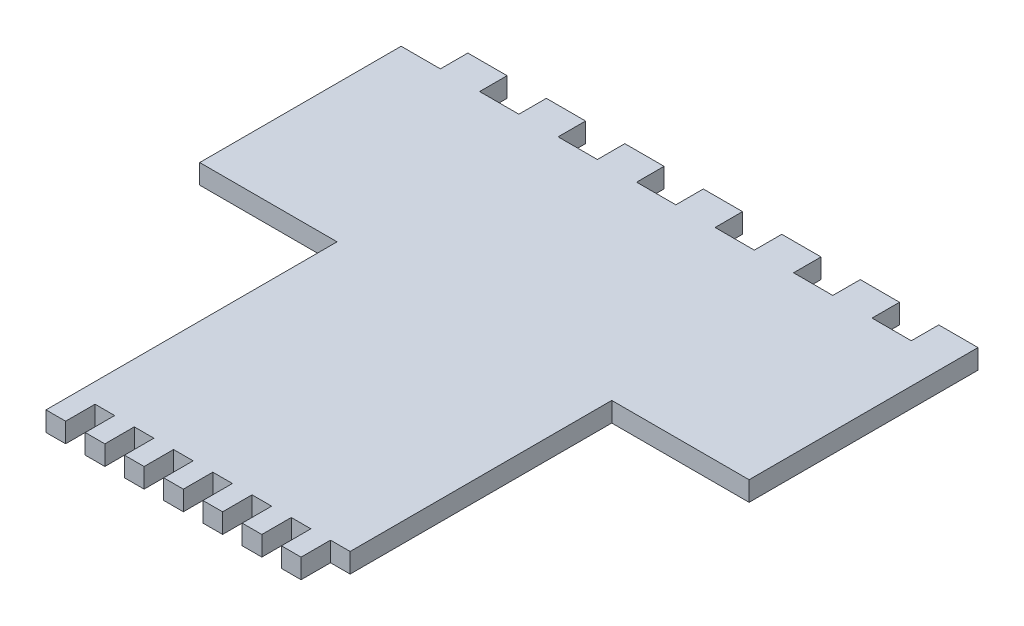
from build123d import *

# Parameters (mm, degrees)
SKETCH1_W           = 177.8
SKETCH1_H           = 169.3418
SKETCH1_W_2         = 355.6
SKETCH1_H_2         = 148.1582
BOSS_EXTRUDE1_DEPTH = 12.7
SKETCH2_W           = 12.7
SKETCH2_H           = 12.7
BOSS_EXTRUDE2_DEPTH = 19.05
SKETCH5_W           = 12.7
SKETCH5_H           = 12.7
CUT_EXTRUDE1_DEPTH  = 19.05
SKETCH6_W           = 12.7
SKETCH6_H           = 12.7
BOSS_EXTRUDE3_DEPTH = 19.05
SKETCH7_W           = 25.4
SKETCH7_H           = 17.78
CUT_EXTRUDE2_DEPTH  = 25.4


with BuildPart() as part:
    # Sketch1 → Boss-Extrude1 (new body)
    with BuildSketch(Plane(origin=(0, 0, 0), x_dir=(1, 0, 0), z_dir=(0, 1, 0))):
        with Locations((177.8, -232.8291)):
            Rectangle(SKETCH1_W, SKETCH1_H)
        with Locations((177.8, -74.0791)):
            Rectangle(SKETCH1_W_2, SKETCH1_H_2)
    extrude(amount=-BOSS_EXTRUDE1_DEPTH)

    # Sketch2 → Boss-Extrude2 (add)
    with BuildSketch(Plane.XY.offset(317.5)):
        Polygon((101.6, 0), (88.9, 0), (88.9, -12.7), (101.6, -12.688292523), align=None)
        with Locations((120.65, -6.35)):
            Rectangle(SKETCH2_W, SKETCH2_H)
        with Locations((146.05, -6.35)):
            Rectangle(SKETCH2_W, SKETCH2_H)
        with Locations((171.45, -6.35)):
            Rectangle(SKETCH2_W, SKETCH2_H)
        with Locations((196.85, -6.35)):
            Rectangle(SKETCH2_W, SKETCH2_H)
        with Locations((222.25, -6.35)):
            Rectangle(SKETCH2_W, SKETCH2_H)
        with Locations((247.65, -6.35)):
            Rectangle(SKETCH2_W, SKETCH2_H)
    extrude(amount=BOSS_EXTRUDE2_DEPTH)

    # Sketch5 → Cut-Extrude1 (cut)
    with BuildSketch(Plane.XY.offset(336.55)):
        with Locations((222.25, -6.35)):
            Rectangle(SKETCH5_W, SKETCH5_H)
    extrude(amount=-CUT_EXTRUDE1_DEPTH, mode=Mode.SUBTRACT)

    # Sketch6 → Boss-Extrude3 (add)
    with BuildSketch(Plane.XY.offset(317.5)):
        with Locations((222.25, -6.35)):
            Rectangle(SKETCH6_W, SKETCH6_H)
    extrude(amount=BOSS_EXTRUDE3_DEPTH)

    # Sketch7 → Cut-Extrude2 (cut)
    with BuildSketch(Plane(origin=(0, 0, 0), x_dir=(1, 0, 0), z_dir=(0, 1, 0))):
        with Locations((12.7, -8.89)):
            Rectangle(SKETCH7_W, SKETCH7_H)
        with Locations((63.5, -8.89)):
            Rectangle(SKETCH7_W, SKETCH7_H)
        with Locations((114.3, -8.89)):
            Rectangle(SKETCH7_W, SKETCH7_H)
        with Locations((165.1, -8.89)):
            Rectangle(SKETCH7_W, SKETCH7_H)
        with Locations((215.9, -8.89)):
            Rectangle(SKETCH7_W, SKETCH7_H)
        with Locations((266.7, -8.89)):
            Rectangle(SKETCH7_W, SKETCH7_H)
        with Locations((317.5, -8.89)):
            Rectangle(SKETCH7_W, SKETCH7_H)
    extrude(amount=-CUT_EXTRUDE2_DEPTH, mode=Mode.SUBTRACT)


solid = part.part
